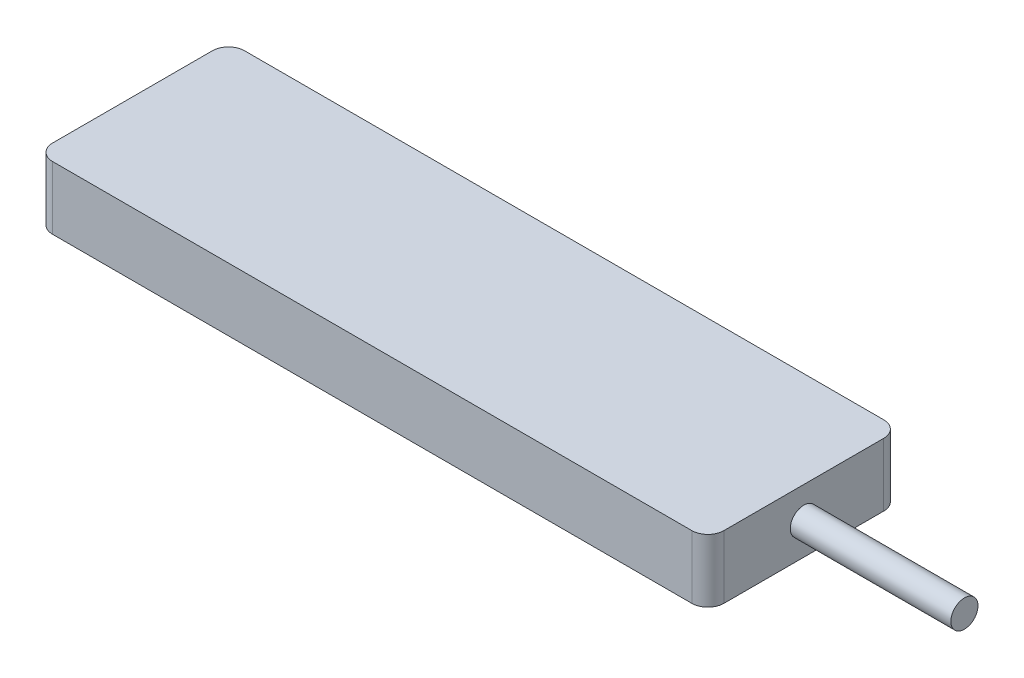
ISO-10303-21;
HEADER;
FILE_DESCRIPTION(('STEP AP214'),'2;1');
FILE_NAME('part.step','',(''),(''),'','','');
FILE_SCHEMA(('AUTOMOTIVE_DESIGN { 1 0 10303 214 1 1 1 1 }'));
ENDSEC;
DATA;
#1=APPLICATION_CONTEXT('core data for automotive mechanical design processes');
#2=APPLICATION_PROTOCOL_DEFINITION('international standard','automotive_design',2000,#1);
#3=PRODUCT_CONTEXT('',#1,'mechanical');
#4=PRODUCT('Part','Part','',(#3));
#5=PRODUCT_RELATED_PRODUCT_CATEGORY('part','',(#4));
#6=PRODUCT_DEFINITION_FORMATION('','',#4);
#7=PRODUCT_DEFINITION_CONTEXT('part definition',#1,'design');
#8=PRODUCT_DEFINITION('design','',#6,#7);
#9=PRODUCT_DEFINITION_SHAPE('','',#8);
#10=(LENGTH_UNIT() NAMED_UNIT(*) SI_UNIT(.MILLI.,.METRE.));
#11=(NAMED_UNIT(*) PLANE_ANGLE_UNIT() SI_UNIT($,.RADIAN.));
#12=(NAMED_UNIT(*) SI_UNIT($,.STERADIAN.) SOLID_ANGLE_UNIT());
#13=UNCERTAINTY_MEASURE_WITH_UNIT(LENGTH_MEASURE(1.E-05),#10,'distance_accuracy_value','');
#14=(GEOMETRIC_REPRESENTATION_CONTEXT(3) GLOBAL_UNCERTAINTY_ASSIGNED_CONTEXT((#13)) GLOBAL_UNIT_ASSIGNED_CONTEXT((#10,
#11,#12)) REPRESENTATION_CONTEXT('',''));
#15=CARTESIAN_POINT('',(0.,0.,0.));
#16=DIRECTION('',(0.,0.,1.));
#17=DIRECTION('',(1.,0.,0.));
#18=AXIS2_PLACEMENT_3D('',#15,#16,#17);
#19=CARTESIAN_POINT('',(0.,9.9695,0.));
#20=DIRECTION('',(1.,0.,0.));
#21=DIRECTION('',(0.,0.,-1.));
#22=AXIS2_PLACEMENT_3D('',#19,#20,#21);
#23=PLANE('',#22);
#24=DIRECTION('',(0.,0.,1.));
#25=VECTOR('',#24,1.);
#26=CARTESIAN_POINT('',(0.,0.,0.));
#27=LINE('',#26,#25);
#28=CARTESIAN_POINT('',(0.,0.,-27.813));
#29=VERTEX_POINT('',#28);
#30=CARTESIAN_POINT('',(0.,0.,-2.54));
#31=VERTEX_POINT('',#30);
#32=EDGE_CURVE('E322',#29,#31,#27,.T.);
#33=ORIENTED_EDGE('',*,*,#32,.T.);
#34=DIRECTION('',(0.,-1.,0.));
#35=VECTOR('',#34,1.);
#36=CARTESIAN_POINT('',(0.,9.9695,-2.54));
#37=LINE('',#36,#35);
#38=CARTESIAN_POINT('',(0.,9.9695,-2.54));
#39=VERTEX_POINT('',#38);
#40=EDGE_CURVE('E368',#31,#39,#37,.F.);
#41=ORIENTED_EDGE('',*,*,#40,.T.);
#42=DIRECTION('',(0.,0.,1.));
#43=VECTOR('',#42,1.);
#44=CARTESIAN_POINT('',(0.,9.9695,0.));
#45=LINE('',#44,#43);
#46=CARTESIAN_POINT('',(0.,9.9695,-27.813));
#47=VERTEX_POINT('',#46);
#48=EDGE_CURVE('E329',#47,#39,#45,.T.);
#49=ORIENTED_EDGE('',*,*,#48,.F.);
#50=DIRECTION('',(0.,-1.,0.));
#51=VECTOR('',#50,1.);
#52=CARTESIAN_POINT('',(0.,9.9695,-27.813));
#53=LINE('',#52,#51);
#54=EDGE_CURVE('E365',#47,#29,#53,.T.);
#55=ORIENTED_EDGE('',*,*,#54,.T.);
#56=EDGE_LOOP('',(#33,#41,#49,#55));
#57=FACE_BOUND('',#56,.T.);
#58=ADVANCED_FACE('F33',(#57),#23,.F.);
#59=CARTESIAN_POINT('',(0.,9.9695,0.));
#60=DIRECTION('',(0.,0.,-1.));
#61=DIRECTION('',(-1.,0.,0.));
#62=AXIS2_PLACEMENT_3D('',#59,#60,#61);
#63=PLANE('',#62);
#64=DIRECTION('',(1.,0.,0.));
#65=VECTOR('',#64,1.);
#66=CARTESIAN_POINT('',(0.,9.9695,0.));
#67=LINE('',#66,#65);
#68=CARTESIAN_POINT('',(2.54,9.9695,0.));
#69=VERTEX_POINT('',#68);
#70=CARTESIAN_POINT('',(103.632,9.9695,0.));
#71=VERTEX_POINT('',#70);
#72=EDGE_CURVE('E332',#69,#71,#67,.T.);
#73=ORIENTED_EDGE('',*,*,#72,.F.);
#74=DIRECTION('',(0.,-1.,0.));
#75=VECTOR('',#74,1.);
#76=CARTESIAN_POINT('',(2.54,9.9695,0.));
#77=LINE('',#76,#75);
#78=CARTESIAN_POINT('',(2.54,0.,0.));
#79=VERTEX_POINT('',#78);
#80=EDGE_CURVE('E354',#69,#79,#77,.T.);
#81=ORIENTED_EDGE('',*,*,#80,.T.);
#82=DIRECTION('',(1.,0.,0.));
#83=VECTOR('',#82,1.);
#84=CARTESIAN_POINT('',(0.,0.,0.));
#85=LINE('',#84,#83);
#86=CARTESIAN_POINT('',(103.632,0.,0.));
#87=VERTEX_POINT('',#86);
#88=EDGE_CURVE('E345',#79,#87,#85,.T.);
#89=ORIENTED_EDGE('',*,*,#88,.T.);
#90=DIRECTION('',(0.,-1.,0.));
#91=VECTOR('',#90,1.);
#92=CARTESIAN_POINT('',(103.632,9.9695,0.));
#93=LINE('',#92,#91);
#94=EDGE_CURVE('E342',#87,#71,#93,.F.);
#95=ORIENTED_EDGE('',*,*,#94,.T.);
#96=EDGE_LOOP('',(#73,#81,#89,#95));
#97=FACE_BOUND('',#96,.T.);
#98=ADVANCED_FACE('F420',(#97),#63,.F.);
#99=CARTESIAN_POINT('',(106.172,9.9695,0.));
#100=DIRECTION('',(-1.,0.,0.));
#101=DIRECTION('',(0.,0.,1.));
#102=AXIS2_PLACEMENT_3D('',#99,#100,#101);
#103=PLANE('',#102);
#104=CARTESIAN_POINT('',(106.172,4.98475,-15.1765));
#105=DIRECTION('',(-1.,0.,0.));
#106=DIRECTION('',(0.,0.,1.));
#107=AXIS2_PLACEMENT_3D('',#104,#105,#106);
#108=CIRCLE('',#107,2.1463);
#109=CARTESIAN_POINT('',(106.172,4.98475,-13.0302));
#110=VERTEX_POINT('',#109);
#111=EDGE_CURVE('E11',#110,#110,#108,.F.);
#112=ORIENTED_EDGE('',*,*,#111,.F.);
#113=EDGE_LOOP('',(#112));
#114=FACE_BOUND('',#113,.T.);
#115=DIRECTION('',(0.,0.,-1.));
#116=VECTOR('',#115,1.);
#117=CARTESIAN_POINT('',(106.172,0.,0.));
#118=LINE('',#117,#116);
#119=CARTESIAN_POINT('',(106.172,0.,-2.54));
#120=VERTEX_POINT('',#119);
#121=CARTESIAN_POINT('',(106.172,0.,-27.813));
#122=VERTEX_POINT('',#121);
#123=EDGE_CURVE('E348',#120,#122,#118,.T.);
#124=ORIENTED_EDGE('',*,*,#123,.T.);
#125=DIRECTION('',(0.,-1.,0.));
#126=VECTOR('',#125,1.);
#127=CARTESIAN_POINT('',(106.172,9.9695,-27.813));
#128=LINE('',#127,#126);
#129=CARTESIAN_POINT('',(106.172,9.9695,-27.813));
#130=VERTEX_POINT('',#129);
#131=EDGE_CURVE('E41',#122,#130,#128,.F.);
#132=ORIENTED_EDGE('',*,*,#131,.T.);
#133=DIRECTION('',(0.,0.,-1.));
#134=VECTOR('',#133,1.);
#135=CARTESIAN_POINT('',(106.172,9.9695,0.));
#136=LINE('',#135,#134);
#137=CARTESIAN_POINT('',(106.172,9.9695,-2.54));
#138=VERTEX_POINT('',#137);
#139=EDGE_CURVE('E336',#138,#130,#136,.T.);
#140=ORIENTED_EDGE('',*,*,#139,.F.);
#141=DIRECTION('',(0.,-1.,0.));
#142=VECTOR('',#141,1.);
#143=CARTESIAN_POINT('',(106.172,9.9695,-2.54));
#144=LINE('',#143,#142);
#145=EDGE_CURVE('E383',#138,#120,#144,.T.);
#146=ORIENTED_EDGE('',*,*,#145,.T.);
#147=EDGE_LOOP('',(#124,#132,#140,#146));
#148=FACE_BOUND('',#147,.T.);
#149=ADVANCED_FACE('F388',(#114,#148),#103,.F.);
#150=CARTESIAN_POINT('',(0.,9.9695,-30.353));
#151=DIRECTION('',(0.,0.,1.));
#152=DIRECTION('',(1.,0.,0.));
#153=AXIS2_PLACEMENT_3D('',#150,#151,#152);
#154=PLANE('',#153);
#155=DIRECTION('',(-1.,0.,0.));
#156=VECTOR('',#155,1.);
#157=CARTESIAN_POINT('',(56.4642,2.44475,-30.353));
#158=LINE('',#157,#156);
#159=CARTESIAN_POINT('',(56.4642,2.44475,-30.353));
#160=VERTEX_POINT('',#159);
#161=CARTESIAN_POINT('',(43.8912,2.44475,-30.353));
#162=VERTEX_POINT('',#161);
#163=EDGE_CURVE('E225',#160,#162,#158,.T.);
#164=ORIENTED_EDGE('',*,*,#163,.F.);
#165=DIRECTION('',(0.,-1.,0.));
#166=VECTOR('',#165,1.);
#167=CARTESIAN_POINT('',(56.4642,2.44475,-30.353));
#168=LINE('',#167,#166);
#169=CARTESIAN_POINT('',(56.4642,7.52475,-30.353));
#170=VERTEX_POINT('',#169);
#171=EDGE_CURVE('E48',#170,#160,#168,.T.);
#172=ORIENTED_EDGE('',*,*,#171,.F.);
#173=DIRECTION('',(1.,0.,0.));
#174=VECTOR('',#173,1.);
#175=CARTESIAN_POINT('',(56.4642,7.52475,-30.353));
#176=LINE('',#175,#174);
#177=CARTESIAN_POINT('',(43.8912,7.52475,-30.353));
#178=VERTEX_POINT('',#177);
#179=EDGE_CURVE('E214',#178,#170,#176,.T.);
#180=ORIENTED_EDGE('',*,*,#179,.F.);
#181=DIRECTION('',(0.,1.,0.));
#182=VECTOR('',#181,1.);
#183=CARTESIAN_POINT('',(43.8912,2.44475,-30.353));
#184=LINE('',#183,#182);
#185=EDGE_CURVE('E217',#162,#178,#184,.T.);
#186=ORIENTED_EDGE('',*,*,#185,.F.);
#187=EDGE_LOOP('',(#164,#172,#180,#186));
#188=FACE_BOUND('',#187,.T.);
#189=DIRECTION('',(-1.,0.,0.));
#190=VECTOR('',#189,1.);
#191=CARTESIAN_POINT('',(36.5887,2.44475,-30.353));
#192=LINE('',#191,#190);
#193=CARTESIAN_POINT('',(36.5887,2.44475,-30.353));
#194=VERTEX_POINT('',#193);
#195=CARTESIAN_POINT('',(24.0157,2.44475,-30.353));
#196=VERTEX_POINT('',#195);
#197=EDGE_CURVE('E251',#194,#196,#192,.T.);
#198=ORIENTED_EDGE('',*,*,#197,.F.);
#199=DIRECTION('',(0.,-1.,0.));
#200=VECTOR('',#199,1.);
#201=CARTESIAN_POINT('',(36.5887,2.44475,-30.353));
#202=LINE('',#201,#200);
#203=CARTESIAN_POINT('',(36.5887,7.52475,-30.353));
#204=VERTEX_POINT('',#203);
#205=EDGE_CURVE('E56',#204,#194,#202,.T.);
#206=ORIENTED_EDGE('',*,*,#205,.F.);
#207=DIRECTION('',(1.,0.,0.));
#208=VECTOR('',#207,1.);
#209=CARTESIAN_POINT('',(36.5887,7.52475,-30.353));
#210=LINE('',#209,#208);
#211=CARTESIAN_POINT('',(24.0157,7.52475,-30.353));
#212=VERTEX_POINT('',#211);
#213=EDGE_CURVE('E240',#212,#204,#210,.T.);
#214=ORIENTED_EDGE('',*,*,#213,.F.);
#215=DIRECTION('',(0.,1.,0.));
#216=VECTOR('',#215,1.);
#217=CARTESIAN_POINT('',(24.0157,2.44475,-30.353));
#218=LINE('',#217,#216);
#219=EDGE_CURVE('E255',#196,#212,#218,.T.);
#220=ORIENTED_EDGE('',*,*,#219,.F.);
#221=EDGE_LOOP('',(#198,#206,#214,#220));
#222=FACE_BOUND('',#221,.T.);
#223=DIRECTION('',(-1.,0.,0.));
#224=VECTOR('',#223,1.);
#225=CARTESIAN_POINT('',(16.7132,2.44475,-30.353));
#226=LINE('',#225,#224);
#227=CARTESIAN_POINT('',(16.7132,2.44475,-30.353));
#228=VERTEX_POINT('',#227);
#229=CARTESIAN_POINT('',(4.1402,2.44475,-30.353));
#230=VERTEX_POINT('',#229);
#231=EDGE_CURVE('E282',#228,#230,#226,.T.);
#232=ORIENTED_EDGE('',*,*,#231,.F.);
#233=DIRECTION('',(0.,-1.,0.));
#234=VECTOR('',#233,1.);
#235=CARTESIAN_POINT('',(16.7132,2.44475,-30.353));
#236=LINE('',#235,#234);
#237=CARTESIAN_POINT('',(16.7132,7.52475,-30.353));
#238=VERTEX_POINT('',#237);
#239=EDGE_CURVE('E280',#238,#228,#236,.T.);
#240=ORIENTED_EDGE('',*,*,#239,.F.);
#241=DIRECTION('',(1.,0.,0.));
#242=VECTOR('',#241,1.);
#243=CARTESIAN_POINT('',(16.7132,7.52475,-30.353));
#244=LINE('',#243,#242);
#245=CARTESIAN_POINT('',(4.1402,7.52475,-30.353));
#246=VERTEX_POINT('',#245);
#247=EDGE_CURVE('E270',#246,#238,#244,.T.);
#248=ORIENTED_EDGE('',*,*,#247,.F.);
#249=DIRECTION('',(0.,1.,0.));
#250=VECTOR('',#249,1.);
#251=CARTESIAN_POINT('',(4.1402,2.44475,-30.353));
#252=LINE('',#251,#250);
#253=EDGE_CURVE('E285',#230,#246,#252,.T.);
#254=ORIENTED_EDGE('',*,*,#253,.F.);
#255=EDGE_LOOP('',(#232,#240,#248,#254));
#256=FACE_BOUND('',#255,.T.);
#257=DIRECTION('',(-1.,0.,0.));
#258=VECTOR('',#257,1.);
#259=CARTESIAN_POINT('',(76.3397,2.44475,-30.353));
#260=LINE('',#259,#258);
#261=CARTESIAN_POINT('',(76.3397,2.44475,-30.353));
#262=VERTEX_POINT('',#261);
#263=CARTESIAN_POINT('',(63.7667,2.44475,-30.353));
#264=VERTEX_POINT('',#263);
#265=EDGE_CURVE('E312',#262,#264,#260,.T.);
#266=ORIENTED_EDGE('',*,*,#265,.F.);
#267=DIRECTION('',(0.,-1.,0.));
#268=VECTOR('',#267,1.);
#269=CARTESIAN_POINT('',(76.3397,2.44475,-30.353));
#270=LINE('',#269,#268);
#271=CARTESIAN_POINT('',(76.3397,7.52475,-30.353));
#272=VERTEX_POINT('',#271);
#273=EDGE_CURVE('E232',#272,#262,#270,.T.);
#274=ORIENTED_EDGE('',*,*,#273,.F.);
#275=DIRECTION('',(1.,0.,0.));
#276=VECTOR('',#275,1.);
#277=CARTESIAN_POINT('',(76.3397,7.52475,-30.353));
#278=LINE('',#277,#276);
#279=CARTESIAN_POINT('',(63.7667,7.52475,-30.353));
#280=VERTEX_POINT('',#279);
#281=EDGE_CURVE('E301',#280,#272,#278,.T.);
#282=ORIENTED_EDGE('',*,*,#281,.F.);
#283=DIRECTION('',(0.,1.,0.));
#284=VECTOR('',#283,1.);
#285=CARTESIAN_POINT('',(63.7667,2.44475,-30.353));
#286=LINE('',#285,#284);
#287=EDGE_CURVE('E315',#264,#280,#286,.T.);
#288=ORIENTED_EDGE('',*,*,#287,.F.);
#289=EDGE_LOOP('',(#266,#274,#282,#288));
#290=FACE_BOUND('',#289,.T.);
#291=DIRECTION('',(-1.,0.,0.));
#292=VECTOR('',#291,1.);
#293=CARTESIAN_POINT('',(0.,0.,-30.353));
#294=LINE('',#293,#292);
#295=CARTESIAN_POINT('',(103.632,0.,-30.353));
#296=VERTEX_POINT('',#295);
#297=CARTESIAN_POINT('',(2.54,0.,-30.353));
#298=VERTEX_POINT('',#297);
#299=EDGE_CURVE('E333',#296,#298,#294,.T.);
#300=ORIENTED_EDGE('',*,*,#299,.T.);
#301=DIRECTION('',(0.,-1.,0.));
#302=VECTOR('',#301,1.);
#303=CARTESIAN_POINT('',(2.54,9.9695,-30.353));
#304=LINE('',#303,#302);
#305=CARTESIAN_POINT('',(2.54,9.9695,-30.353));
#306=VERTEX_POINT('',#305);
#307=EDGE_CURVE('E381',#298,#306,#304,.F.);
#308=ORIENTED_EDGE('',*,*,#307,.T.);
#309=DIRECTION('',(-1.,0.,0.));
#310=VECTOR('',#309,1.);
#311=CARTESIAN_POINT('',(0.,9.9695,-30.353));
#312=LINE('',#311,#310);
#313=CARTESIAN_POINT('',(103.632,9.9695,-30.353));
#314=VERTEX_POINT('',#313);
#315=EDGE_CURVE('E339',#314,#306,#312,.T.);
#316=ORIENTED_EDGE('',*,*,#315,.F.);
#317=DIRECTION('',(0.,-1.,0.));
#318=VECTOR('',#317,1.);
#319=CARTESIAN_POINT('',(103.632,9.9695,-30.353));
#320=LINE('',#319,#318);
#321=EDGE_CURVE('E378',#314,#296,#320,.T.);
#322=ORIENTED_EDGE('',*,*,#321,.T.);
#323=EDGE_LOOP('',(#300,#308,#316,#322));
#324=FACE_BOUND('',#323,.T.);
#325=ADVANCED_FACE('F401',(#188,#222,#256,#290,#324),#154,.F.);
#326=CARTESIAN_POINT('',(0.,9.9695,0.));
#327=DIRECTION('',(0.,-1.,0.));
#328=DIRECTION('',(0.,0.,-1.));
#329=AXIS2_PLACEMENT_3D('',#326,#327,#328);
#330=PLANE('',#329);
#331=ORIENTED_EDGE('',*,*,#48,.T.);
#332=CARTESIAN_POINT('',(2.54,9.9695,-2.54));
#333=DIRECTION('',(0.,-1.,0.));
#334=DIRECTION('',(0.,0.,-1.));
#335=AXIS2_PLACEMENT_3D('',#332,#333,#334);
#336=CIRCLE('',#335,2.54);
#337=EDGE_CURVE('E376',#39,#69,#336,.F.);
#338=ORIENTED_EDGE('',*,*,#337,.T.);
#339=ORIENTED_EDGE('',*,*,#72,.T.);
#340=CARTESIAN_POINT('',(103.632,9.9695,-2.54));
#341=DIRECTION('',(0.,-1.,0.));
#342=DIRECTION('',(0.,0.,-1.));
#343=AXIS2_PLACEMENT_3D('',#340,#341,#342);
#344=CIRCLE('',#343,2.54);
#345=EDGE_CURVE('E370',#71,#138,#344,.F.);
#346=ORIENTED_EDGE('',*,*,#345,.T.);
#347=ORIENTED_EDGE('',*,*,#139,.T.);
#348=CARTESIAN_POINT('',(103.632,9.9695,-27.813));
#349=DIRECTION('',(0.,-1.,0.));
#350=DIRECTION('',(0.,0.,-1.));
#351=AXIS2_PLACEMENT_3D('',#348,#349,#350);
#352=CIRCLE('',#351,2.54);
#353=EDGE_CURVE('E372',#130,#314,#352,.F.);
#354=ORIENTED_EDGE('',*,*,#353,.T.);
#355=ORIENTED_EDGE('',*,*,#315,.T.);
#356=CARTESIAN_POINT('',(2.54,9.9695,-27.813));
#357=DIRECTION('',(0.,-1.,0.));
#358=DIRECTION('',(0.,0.,-1.));
#359=AXIS2_PLACEMENT_3D('',#356,#357,#358);
#360=CIRCLE('',#359,2.54);
#361=EDGE_CURVE('E374',#306,#47,#360,.F.);
#362=ORIENTED_EDGE('',*,*,#361,.T.);
#363=EDGE_LOOP('',(#331,#338,#339,#346,#347,#354,#355,#362));
#364=FACE_BOUND('',#363,.T.);
#365=ADVANCED_FACE('F394',(#364),#330,.F.);
#366=CARTESIAN_POINT('',(0.,0.,0.));
#367=DIRECTION('',(0.,-1.,0.));
#368=DIRECTION('',(0.,0.,-1.));
#369=AXIS2_PLACEMENT_3D('',#366,#367,#368);
#370=PLANE('',#369);
#371=ORIENTED_EDGE('',*,*,#88,.F.);
#372=CARTESIAN_POINT('',(2.54,0.,-2.54));
#373=DIRECTION('',(0.,-1.,0.));
#374=DIRECTION('',(0.,0.,-1.));
#375=AXIS2_PLACEMENT_3D('',#372,#373,#374);
#376=CIRCLE('',#375,2.54);
#377=EDGE_CURVE('E363',#79,#31,#376,.T.);
#378=ORIENTED_EDGE('',*,*,#377,.T.);
#379=ORIENTED_EDGE('',*,*,#32,.F.);
#380=CARTESIAN_POINT('',(2.54,0.,-27.813));
#381=DIRECTION('',(0.,-1.,0.));
#382=DIRECTION('',(0.,0.,-1.));
#383=AXIS2_PLACEMENT_3D('',#380,#381,#382);
#384=CIRCLE('',#383,2.54);
#385=EDGE_CURVE('E361',#29,#298,#384,.T.);
#386=ORIENTED_EDGE('',*,*,#385,.T.);
#387=ORIENTED_EDGE('',*,*,#299,.F.);
#388=CARTESIAN_POINT('',(103.632,0.,-27.813));
#389=DIRECTION('',(0.,-1.,0.));
#390=DIRECTION('',(0.,0.,-1.));
#391=AXIS2_PLACEMENT_3D('',#388,#389,#390);
#392=CIRCLE('',#391,2.54);
#393=EDGE_CURVE('E359',#296,#122,#392,.T.);
#394=ORIENTED_EDGE('',*,*,#393,.T.);
#395=ORIENTED_EDGE('',*,*,#123,.F.);
#396=CARTESIAN_POINT('',(103.632,0.,-2.54));
#397=DIRECTION('',(0.,-1.,0.));
#398=DIRECTION('',(0.,0.,-1.));
#399=AXIS2_PLACEMENT_3D('',#396,#397,#398);
#400=CIRCLE('',#399,2.54);
#401=EDGE_CURVE('E357',#120,#87,#400,.T.);
#402=ORIENTED_EDGE('',*,*,#401,.T.);
#403=EDGE_LOOP('',(#371,#378,#379,#386,#387,#394,#395,#402));
#404=FACE_BOUND('',#403,.T.);
#405=ADVANCED_FACE('F405',(#404),#370,.T.);
#406=CARTESIAN_POINT('',(2.54,9.9695,-2.54));
#407=DIRECTION('',(0.,-1.,0.));
#408=DIRECTION('',(0.,0.,-1.));
#409=AXIS2_PLACEMENT_3D('',#406,#407,#408);
#410=CYLINDRICAL_SURFACE('',#409,2.54);
#411=ORIENTED_EDGE('',*,*,#337,.F.);
#412=ORIENTED_EDGE('',*,*,#40,.F.);
#413=ORIENTED_EDGE('',*,*,#377,.F.);
#414=ORIENTED_EDGE('',*,*,#80,.F.);
#415=EDGE_LOOP('',(#411,#412,#413,#414));
#416=FACE_BOUND('',#415,.T.);
#417=ADVANCED_FACE('F418',(#416),#410,.T.);
#418=CARTESIAN_POINT('',(2.54,9.9695,-27.813));
#419=DIRECTION('',(0.,-1.,0.));
#420=DIRECTION('',(0.,0.,-1.));
#421=AXIS2_PLACEMENT_3D('',#418,#419,#420);
#422=CYLINDRICAL_SURFACE('',#421,2.54);
#423=ORIENTED_EDGE('',*,*,#361,.F.);
#424=ORIENTED_EDGE('',*,*,#307,.F.);
#425=ORIENTED_EDGE('',*,*,#385,.F.);
#426=ORIENTED_EDGE('',*,*,#54,.F.);
#427=EDGE_LOOP('',(#423,#424,#425,#426));
#428=FACE_BOUND('',#427,.T.);
#429=ADVANCED_FACE('F410',(#428),#422,.T.);
#430=CARTESIAN_POINT('',(103.632,9.9695,-27.813));
#431=DIRECTION('',(0.,-1.,0.));
#432=DIRECTION('',(0.,0.,-1.));
#433=AXIS2_PLACEMENT_3D('',#430,#431,#432);
#434=CYLINDRICAL_SURFACE('',#433,2.54);
#435=ORIENTED_EDGE('',*,*,#353,.F.);
#436=ORIENTED_EDGE('',*,*,#131,.F.);
#437=ORIENTED_EDGE('',*,*,#393,.F.);
#438=ORIENTED_EDGE('',*,*,#321,.F.);
#439=EDGE_LOOP('',(#435,#436,#437,#438));
#440=FACE_BOUND('',#439,.T.);
#441=ADVANCED_FACE('F398',(#440),#434,.T.);
#442=CARTESIAN_POINT('',(103.632,9.9695,-2.54));
#443=DIRECTION('',(0.,-1.,0.));
#444=DIRECTION('',(0.,0.,-1.));
#445=AXIS2_PLACEMENT_3D('',#442,#443,#444);
#446=CYLINDRICAL_SURFACE('',#445,2.54);
#447=ORIENTED_EDGE('',*,*,#345,.F.);
#448=ORIENTED_EDGE('',*,*,#94,.F.);
#449=ORIENTED_EDGE('',*,*,#401,.F.);
#450=ORIENTED_EDGE('',*,*,#145,.F.);
#451=EDGE_LOOP('',(#447,#448,#449,#450));
#452=FACE_BOUND('',#451,.T.);
#453=ADVANCED_FACE('F35',(#452),#446,.T.);
#454=CARTESIAN_POINT('',(76.3397,2.44475,-21.717));
#455=DIRECTION('',(1.,0.,0.));
#456=DIRECTION('',(0.,0.,-1.));
#457=AXIS2_PLACEMENT_3D('',#454,#455,#456);
#458=PLANE('',#457);
#459=ORIENTED_EDGE('',*,*,#273,.T.);
#460=DIRECTION('',(0.,0.,-1.));
#461=VECTOR('',#460,1.);
#462=CARTESIAN_POINT('',(76.3397,2.44475,-21.717));
#463=LINE('',#462,#461);
#464=CARTESIAN_POINT('',(76.3397,2.44475,-21.717));
#465=VERTEX_POINT('',#464);
#466=EDGE_CURVE('E310',#465,#262,#463,.T.);
#467=ORIENTED_EDGE('',*,*,#466,.F.);
#468=DIRECTION('',(0.,-1.,0.));
#469=VECTOR('',#468,1.);
#470=CARTESIAN_POINT('',(76.3397,2.44475,-21.717));
#471=LINE('',#470,#469);
#472=CARTESIAN_POINT('',(76.3397,7.52475,-21.717));
#473=VERTEX_POINT('',#472);
#474=EDGE_CURVE('E297',#473,#465,#471,.T.);
#475=ORIENTED_EDGE('',*,*,#474,.F.);
#476=DIRECTION('',(0.,0.,-1.));
#477=VECTOR('',#476,1.);
#478=CARTESIAN_POINT('',(76.3397,7.52475,-21.717));
#479=LINE('',#478,#477);
#480=EDGE_CURVE('E320',#473,#272,#479,.T.);
#481=ORIENTED_EDGE('',*,*,#480,.T.);
#482=EDGE_LOOP('',(#459,#467,#475,#481));
#483=FACE_BOUND('',#482,.T.);
#484=ADVANCED_FACE('F424',(#483),#458,.F.);
#485=CARTESIAN_POINT('',(76.3397,7.52475,-21.717));
#486=DIRECTION('',(0.,1.,0.));
#487=DIRECTION('',(0.,0.,1.));
#488=AXIS2_PLACEMENT_3D('',#485,#486,#487);
#489=PLANE('',#488);
#490=ORIENTED_EDGE('',*,*,#281,.T.);
#491=ORIENTED_EDGE('',*,*,#480,.F.);
#492=DIRECTION('',(1.,0.,0.));
#493=VECTOR('',#492,1.);
#494=CARTESIAN_POINT('',(76.3397,7.52475,-21.717));
#495=LINE('',#494,#493);
#496=CARTESIAN_POINT('',(63.7667,7.52475,-21.717));
#497=VERTEX_POINT('',#496);
#498=EDGE_CURVE('E307',#497,#473,#495,.T.);
#499=ORIENTED_EDGE('',*,*,#498,.F.);
#500=DIRECTION('',(0.,0.,-1.));
#501=VECTOR('',#500,1.);
#502=CARTESIAN_POINT('',(63.7667,7.52475,-21.717));
#503=LINE('',#502,#501);
#504=EDGE_CURVE('E323',#497,#280,#503,.T.);
#505=ORIENTED_EDGE('',*,*,#504,.T.);
#506=EDGE_LOOP('',(#490,#491,#499,#505));
#507=FACE_BOUND('',#506,.T.);
#508=ADVANCED_FACE('F429',(#507),#489,.F.);
#509=CARTESIAN_POINT('',(63.7667,2.44475,-21.717));
#510=DIRECTION('',(-1.,0.,0.));
#511=DIRECTION('',(0.,0.,1.));
#512=AXIS2_PLACEMENT_3D('',#509,#510,#511);
#513=PLANE('',#512);
#514=ORIENTED_EDGE('',*,*,#287,.T.);
#515=ORIENTED_EDGE('',*,*,#504,.F.);
#516=DIRECTION('',(0.,1.,0.));
#517=VECTOR('',#516,1.);
#518=CARTESIAN_POINT('',(63.7667,2.44475,-21.717));
#519=LINE('',#518,#517);
#520=CARTESIAN_POINT('',(63.7667,2.44475,-21.717));
#521=VERTEX_POINT('',#520);
#522=EDGE_CURVE('E304',#521,#497,#519,.T.);
#523=ORIENTED_EDGE('',*,*,#522,.F.);
#524=DIRECTION('',(0.,0.,-1.));
#525=VECTOR('',#524,1.);
#526=CARTESIAN_POINT('',(63.7667,2.44475,-21.717));
#527=LINE('',#526,#525);
#528=EDGE_CURVE('E325',#521,#264,#527,.T.);
#529=ORIENTED_EDGE('',*,*,#528,.T.);
#530=EDGE_LOOP('',(#514,#515,#523,#529));
#531=FACE_BOUND('',#530,.T.);
#532=ADVANCED_FACE('F484',(#531),#513,.F.);
#533=CARTESIAN_POINT('',(76.3397,2.44475,-21.717));
#534=DIRECTION('',(0.,-1.,0.));
#535=DIRECTION('',(1.,0.,0.));
#536=AXIS2_PLACEMENT_3D('',#533,#534,#535);
#537=PLANE('',#536);
#538=ORIENTED_EDGE('',*,*,#265,.T.);
#539=ORIENTED_EDGE('',*,*,#528,.F.);
#540=DIRECTION('',(-1.,0.,0.));
#541=VECTOR('',#540,1.);
#542=CARTESIAN_POINT('',(76.3397,2.44475,-21.717));
#543=LINE('',#542,#541);
#544=EDGE_CURVE('E300',#465,#521,#543,.T.);
#545=ORIENTED_EDGE('',*,*,#544,.F.);
#546=ORIENTED_EDGE('',*,*,#466,.T.);
#547=EDGE_LOOP('',(#538,#539,#545,#546));
#548=FACE_BOUND('',#547,.T.);
#549=ADVANCED_FACE('F494',(#548),#537,.F.);
#550=CARTESIAN_POINT('',(0.,0.,-21.717));
#551=DIRECTION('',(0.,0.,1.));
#552=DIRECTION('',(1.,0.,0.));
#553=AXIS2_PLACEMENT_3D('',#550,#551,#552);
#554=PLANE('',#553);
#555=ORIENTED_EDGE('',*,*,#474,.T.);
#556=ORIENTED_EDGE('',*,*,#544,.T.);
#557=ORIENTED_EDGE('',*,*,#522,.T.);
#558=ORIENTED_EDGE('',*,*,#498,.T.);
#559=EDGE_LOOP('',(#555,#556,#557,#558));
#560=FACE_BOUND('',#559,.T.);
#561=ADVANCED_FACE('F504',(#560),#554,.F.);
#562=CARTESIAN_POINT('',(16.7132,2.44475,-21.717));
#563=DIRECTION('',(1.,0.,0.));
#564=DIRECTION('',(0.,0.,-1.));
#565=AXIS2_PLACEMENT_3D('',#562,#563,#564);
#566=PLANE('',#565);
#567=ORIENTED_EDGE('',*,*,#239,.T.);
#568=DIRECTION('',(0.,0.,-1.));
#569=VECTOR('',#568,1.);
#570=CARTESIAN_POINT('',(16.7132,2.44475,-21.717));
#571=LINE('',#570,#569);
#572=CARTESIAN_POINT('',(16.7132,2.44475,-21.717));
#573=VERTEX_POINT('',#572);
#574=EDGE_CURVE('E279',#573,#228,#571,.T.);
#575=ORIENTED_EDGE('',*,*,#574,.F.);
#576=DIRECTION('',(0.,-1.,0.));
#577=VECTOR('',#576,1.);
#578=CARTESIAN_POINT('',(16.7132,2.44475,-21.717));
#579=LINE('',#578,#577);
#580=CARTESIAN_POINT('',(16.7132,7.52475,-21.717));
#581=VERTEX_POINT('',#580);
#582=EDGE_CURVE('E266',#581,#573,#579,.T.);
#583=ORIENTED_EDGE('',*,*,#582,.F.);
#584=DIRECTION('',(0.,0.,-1.));
#585=VECTOR('',#584,1.);
#586=CARTESIAN_POINT('',(16.7132,7.52475,-21.717));
#587=LINE('',#586,#585);
#588=EDGE_CURVE('E252',#581,#238,#587,.T.);
#589=ORIENTED_EDGE('',*,*,#588,.T.);
#590=EDGE_LOOP('',(#567,#575,#583,#589));
#591=FACE_BOUND('',#590,.T.);
#592=ADVANCED_FACE('F514',(#591),#566,.F.);
#593=CARTESIAN_POINT('',(16.7132,7.52475,-21.717));
#594=DIRECTION('',(0.,1.,0.));
#595=DIRECTION('',(0.,0.,1.));
#596=AXIS2_PLACEMENT_3D('',#593,#594,#595);
#597=PLANE('',#596);
#598=ORIENTED_EDGE('',*,*,#247,.T.);
#599=ORIENTED_EDGE('',*,*,#588,.F.);
#600=DIRECTION('',(1.,0.,0.));
#601=VECTOR('',#600,1.);
#602=CARTESIAN_POINT('',(16.7132,7.52475,-21.717));
#603=LINE('',#602,#601);
#604=CARTESIAN_POINT('',(4.1402,7.52475,-21.717));
#605=VERTEX_POINT('',#604);
#606=EDGE_CURVE('E276',#605,#581,#603,.T.);
#607=ORIENTED_EDGE('',*,*,#606,.F.);
#608=DIRECTION('',(0.,0.,-1.));
#609=VECTOR('',#608,1.);
#610=CARTESIAN_POINT('',(4.1402,7.52475,-21.717));
#611=LINE('',#610,#609);
#612=EDGE_CURVE('E291',#605,#246,#611,.T.);
#613=ORIENTED_EDGE('',*,*,#612,.T.);
#614=EDGE_LOOP('',(#598,#599,#607,#613));
#615=FACE_BOUND('',#614,.T.);
#616=ADVANCED_FACE('F524',(#615),#597,.F.);
#617=CARTESIAN_POINT('',(4.1402,2.44475,-21.717));
#618=DIRECTION('',(-1.,0.,0.));
#619=DIRECTION('',(0.,-1.,0.));
#620=AXIS2_PLACEMENT_3D('',#617,#618,#619);
#621=PLANE('',#620);
#622=ORIENTED_EDGE('',*,*,#253,.T.);
#623=ORIENTED_EDGE('',*,*,#612,.F.);
#624=DIRECTION('',(0.,1.,0.));
#625=VECTOR('',#624,1.);
#626=CARTESIAN_POINT('',(4.1402,2.44475,-21.717));
#627=LINE('',#626,#625);
#628=CARTESIAN_POINT('',(4.1402,2.44475,-21.717));
#629=VERTEX_POINT('',#628);
#630=EDGE_CURVE('E273',#629,#605,#627,.T.);
#631=ORIENTED_EDGE('',*,*,#630,.F.);
#632=DIRECTION('',(0.,0.,-1.));
#633=VECTOR('',#632,1.);
#634=CARTESIAN_POINT('',(4.1402,2.44475,-21.717));
#635=LINE('',#634,#633);
#636=EDGE_CURVE('E293',#629,#230,#635,.T.);
#637=ORIENTED_EDGE('',*,*,#636,.T.);
#638=EDGE_LOOP('',(#622,#623,#631,#637));
#639=FACE_BOUND('',#638,.T.);
#640=ADVANCED_FACE('F534',(#639),#621,.F.);
#641=CARTESIAN_POINT('',(16.7132,2.44475,-21.717));
#642=DIRECTION('',(0.,-1.,0.));
#643=DIRECTION('',(0.,0.,-1.));
#644=AXIS2_PLACEMENT_3D('',#641,#642,#643);
#645=PLANE('',#644);
#646=ORIENTED_EDGE('',*,*,#231,.T.);
#647=ORIENTED_EDGE('',*,*,#636,.F.);
#648=DIRECTION('',(-1.,0.,0.));
#649=VECTOR('',#648,1.);
#650=CARTESIAN_POINT('',(16.7132,2.44475,-21.717));
#651=LINE('',#650,#649);
#652=EDGE_CURVE('E269',#573,#629,#651,.T.);
#653=ORIENTED_EDGE('',*,*,#652,.F.);
#654=ORIENTED_EDGE('',*,*,#574,.T.);
#655=EDGE_LOOP('',(#646,#647,#653,#654));
#656=FACE_BOUND('',#655,.T.);
#657=ADVANCED_FACE('F544',(#656),#645,.F.);
#658=CARTESIAN_POINT('',(0.,0.,-21.717));
#659=DIRECTION('',(0.,0.,1.));
#660=DIRECTION('',(1.,0.,0.));
#661=AXIS2_PLACEMENT_3D('',#658,#659,#660);
#662=PLANE('',#661);
#663=ORIENTED_EDGE('',*,*,#582,.T.);
#664=ORIENTED_EDGE('',*,*,#652,.T.);
#665=ORIENTED_EDGE('',*,*,#630,.T.);
#666=ORIENTED_EDGE('',*,*,#606,.T.);
#667=EDGE_LOOP('',(#663,#664,#665,#666));
#668=FACE_BOUND('',#667,.T.);
#669=ADVANCED_FACE('F554',(#668),#662,.F.);
#670=CARTESIAN_POINT('',(36.5887,2.44475,-21.717));
#671=DIRECTION('',(1.,0.,0.));
#672=DIRECTION('',(0.,0.,-1.));
#673=AXIS2_PLACEMENT_3D('',#670,#671,#672);
#674=PLANE('',#673);
#675=ORIENTED_EDGE('',*,*,#205,.T.);
#676=DIRECTION('',(0.,0.,-1.));
#677=VECTOR('',#676,1.);
#678=CARTESIAN_POINT('',(36.5887,2.44475,-21.717));
#679=LINE('',#678,#677);
#680=CARTESIAN_POINT('',(36.5887,2.44475,-21.717));
#681=VERTEX_POINT('',#680);
#682=EDGE_CURVE('E249',#681,#194,#679,.T.);
#683=ORIENTED_EDGE('',*,*,#682,.F.);
#684=DIRECTION('',(0.,-1.,0.));
#685=VECTOR('',#684,1.);
#686=CARTESIAN_POINT('',(36.5887,2.44475,-21.717));
#687=LINE('',#686,#685);
#688=CARTESIAN_POINT('',(36.5887,7.52475,-21.717));
#689=VERTEX_POINT('',#688);
#690=EDGE_CURVE('E236',#689,#681,#687,.T.);
#691=ORIENTED_EDGE('',*,*,#690,.F.);
#692=DIRECTION('',(0.,0.,-1.));
#693=VECTOR('',#692,1.);
#694=CARTESIAN_POINT('',(36.5887,7.52475,-21.717));
#695=LINE('',#694,#693);
#696=EDGE_CURVE('E226',#689,#204,#695,.T.);
#697=ORIENTED_EDGE('',*,*,#696,.T.);
#698=EDGE_LOOP('',(#675,#683,#691,#697));
#699=FACE_BOUND('',#698,.T.);
#700=ADVANCED_FACE('F564',(#699),#674,.F.);
#701=CARTESIAN_POINT('',(36.5887,7.52475,-21.717));
#702=DIRECTION('',(0.,1.,0.));
#703=DIRECTION('',(0.,0.,1.));
#704=AXIS2_PLACEMENT_3D('',#701,#702,#703);
#705=PLANE('',#704);
#706=ORIENTED_EDGE('',*,*,#213,.T.);
#707=ORIENTED_EDGE('',*,*,#696,.F.);
#708=DIRECTION('',(1.,0.,0.));
#709=VECTOR('',#708,1.);
#710=CARTESIAN_POINT('',(36.5887,7.52475,-21.717));
#711=LINE('',#710,#709);
#712=CARTESIAN_POINT('',(24.0157,7.52475,-21.717));
#713=VERTEX_POINT('',#712);
#714=EDGE_CURVE('E246',#713,#689,#711,.T.);
#715=ORIENTED_EDGE('',*,*,#714,.F.);
#716=DIRECTION('',(0.,0.,-1.));
#717=VECTOR('',#716,1.);
#718=CARTESIAN_POINT('',(24.0157,7.52475,-21.717));
#719=LINE('',#718,#717);
#720=EDGE_CURVE('E261',#713,#212,#719,.T.);
#721=ORIENTED_EDGE('',*,*,#720,.T.);
#722=EDGE_LOOP('',(#706,#707,#715,#721));
#723=FACE_BOUND('',#722,.T.);
#724=ADVANCED_FACE('F574',(#723),#705,.F.);
#725=CARTESIAN_POINT('',(24.0157,2.44475,-21.717));
#726=DIRECTION('',(-1.,0.,0.));
#727=DIRECTION('',(0.,0.,1.));
#728=AXIS2_PLACEMENT_3D('',#725,#726,#727);
#729=PLANE('',#728);
#730=ORIENTED_EDGE('',*,*,#219,.T.);
#731=ORIENTED_EDGE('',*,*,#720,.F.);
#732=DIRECTION('',(0.,1.,0.));
#733=VECTOR('',#732,1.);
#734=CARTESIAN_POINT('',(24.0157,2.44475,-21.717));
#735=LINE('',#734,#733);
#736=CARTESIAN_POINT('',(24.0157,2.44475,-21.717));
#737=VERTEX_POINT('',#736);
#738=EDGE_CURVE('E243',#737,#713,#735,.T.);
#739=ORIENTED_EDGE('',*,*,#738,.F.);
#740=DIRECTION('',(0.,0.,-1.));
#741=VECTOR('',#740,1.);
#742=CARTESIAN_POINT('',(24.0157,2.44475,-21.717));
#743=LINE('',#742,#741);
#744=EDGE_CURVE('E263',#737,#196,#743,.T.);
#745=ORIENTED_EDGE('',*,*,#744,.T.);
#746=EDGE_LOOP('',(#730,#731,#739,#745));
#747=FACE_BOUND('',#746,.T.);
#748=ADVANCED_FACE('F583',(#747),#729,.F.);
#749=CARTESIAN_POINT('',(36.5887,2.44475,-21.717));
#750=DIRECTION('',(0.,-1.,0.));
#751=DIRECTION('',(0.,0.,-1.));
#752=AXIS2_PLACEMENT_3D('',#749,#750,#751);
#753=PLANE('',#752);
#754=ORIENTED_EDGE('',*,*,#197,.T.);
#755=ORIENTED_EDGE('',*,*,#744,.F.);
#756=DIRECTION('',(-1.,0.,0.));
#757=VECTOR('',#756,1.);
#758=CARTESIAN_POINT('',(36.5887,2.44475,-21.717));
#759=LINE('',#758,#757);
#760=EDGE_CURVE('E239',#681,#737,#759,.T.);
#761=ORIENTED_EDGE('',*,*,#760,.F.);
#762=ORIENTED_EDGE('',*,*,#682,.T.);
#763=EDGE_LOOP('',(#754,#755,#761,#762));
#764=FACE_BOUND('',#763,.T.);
#765=ADVANCED_FACE('F593',(#764),#753,.F.);
#766=CARTESIAN_POINT('',(0.,0.,-21.717));
#767=DIRECTION('',(0.,0.,1.));
#768=DIRECTION('',(1.,0.,0.));
#769=AXIS2_PLACEMENT_3D('',#766,#767,#768);
#770=PLANE('',#769);
#771=ORIENTED_EDGE('',*,*,#690,.T.);
#772=ORIENTED_EDGE('',*,*,#760,.T.);
#773=ORIENTED_EDGE('',*,*,#738,.T.);
#774=ORIENTED_EDGE('',*,*,#714,.T.);
#775=EDGE_LOOP('',(#771,#772,#773,#774));
#776=FACE_BOUND('',#775,.T.);
#777=ADVANCED_FACE('F603',(#776),#770,.F.);
#778=CARTESIAN_POINT('',(56.4642,2.44475,-21.717));
#779=DIRECTION('',(1.,0.,0.));
#780=DIRECTION('',(0.,0.,-1.));
#781=AXIS2_PLACEMENT_3D('',#778,#779,#780);
#782=PLANE('',#781);
#783=ORIENTED_EDGE('',*,*,#171,.T.);
#784=DIRECTION('',(0.,0.,-1.));
#785=VECTOR('',#784,1.);
#786=CARTESIAN_POINT('',(56.4642,2.44475,-21.717));
#787=LINE('',#786,#785);
#788=CARTESIAN_POINT('',(56.4642,2.44475,-21.717));
#789=VERTEX_POINT('',#788);
#790=EDGE_CURVE('E192',#789,#160,#787,.T.);
#791=ORIENTED_EDGE('',*,*,#790,.F.);
#792=DIRECTION('',(0.,-1.,0.));
#793=VECTOR('',#792,1.);
#794=CARTESIAN_POINT('',(56.4642,2.44475,-21.717));
#795=LINE('',#794,#793);
#796=CARTESIAN_POINT('',(56.4642,7.52475,-21.717));
#797=VERTEX_POINT('',#796);
#798=EDGE_CURVE('E196',#797,#789,#795,.T.);
#799=ORIENTED_EDGE('',*,*,#798,.F.);
#800=DIRECTION('',(0.,0.,-1.));
#801=VECTOR('',#800,1.);
#802=CARTESIAN_POINT('',(56.4642,7.52475,-21.717));
#803=LINE('',#802,#801);
#804=EDGE_CURVE('E230',#797,#170,#803,.T.);
#805=ORIENTED_EDGE('',*,*,#804,.T.);
#806=EDGE_LOOP('',(#783,#791,#799,#805));
#807=FACE_BOUND('',#806,.T.);
#808=ADVANCED_FACE('F194',(#807),#782,.F.);
#809=CARTESIAN_POINT('',(56.4642,7.52475,-21.717));
#810=DIRECTION('',(0.,1.,0.));
#811=DIRECTION('',(0.,0.,1.));
#812=AXIS2_PLACEMENT_3D('',#809,#810,#811);
#813=PLANE('',#812);
#814=ORIENTED_EDGE('',*,*,#179,.T.);
#815=ORIENTED_EDGE('',*,*,#804,.F.);
#816=DIRECTION('',(1.,0.,0.));
#817=VECTOR('',#816,1.);
#818=CARTESIAN_POINT('',(56.4642,7.52475,-21.717));
#819=LINE('',#818,#817);
#820=CARTESIAN_POINT('',(43.8912,7.52475,-21.717));
#821=VERTEX_POINT('',#820);
#822=EDGE_CURVE('E202',#821,#797,#819,.T.);
#823=ORIENTED_EDGE('',*,*,#822,.F.);
#824=DIRECTION('',(0.,0.,-1.));
#825=VECTOR('',#824,1.);
#826=CARTESIAN_POINT('',(43.8912,7.52475,-21.717));
#827=LINE('',#826,#825);
#828=EDGE_CURVE('E233',#821,#178,#827,.T.);
#829=ORIENTED_EDGE('',*,*,#828,.T.);
#830=EDGE_LOOP('',(#814,#815,#823,#829));
#831=FACE_BOUND('',#830,.T.);
#832=ADVANCED_FACE('F622',(#831),#813,.F.);
#833=CARTESIAN_POINT('',(43.8912,2.44475,-21.717));
#834=DIRECTION('',(-1.,0.,0.));
#835=DIRECTION('',(0.,0.,1.));
#836=AXIS2_PLACEMENT_3D('',#833,#834,#835);
#837=PLANE('',#836);
#838=ORIENTED_EDGE('',*,*,#185,.T.);
#839=ORIENTED_EDGE('',*,*,#828,.F.);
#840=DIRECTION('',(0.,1.,0.));
#841=VECTOR('',#840,1.);
#842=CARTESIAN_POINT('',(43.8912,2.44475,-21.717));
#843=LINE('',#842,#841);
#844=CARTESIAN_POINT('',(43.8912,2.44475,-21.717));
#845=VERTEX_POINT('',#844);
#846=EDGE_CURVE('E210',#845,#821,#843,.T.);
#847=ORIENTED_EDGE('',*,*,#846,.F.);
#848=DIRECTION('',(0.,0.,-1.));
#849=VECTOR('',#848,1.);
#850=CARTESIAN_POINT('',(43.8912,2.44475,-21.717));
#851=LINE('',#850,#849);
#852=EDGE_CURVE('E201',#845,#162,#851,.T.);
#853=ORIENTED_EDGE('',*,*,#852,.T.);
#854=EDGE_LOOP('',(#838,#839,#847,#853));
#855=FACE_BOUND('',#854,.T.);
#856=ADVANCED_FACE('F631',(#855),#837,.F.);
#857=CARTESIAN_POINT('',(56.4642,2.44475,-21.717));
#858=DIRECTION('',(0.,-1.,0.));
#859=DIRECTION('',(0.,0.,-1.));
#860=AXIS2_PLACEMENT_3D('',#857,#858,#859);
#861=PLANE('',#860);
#862=ORIENTED_EDGE('',*,*,#163,.T.);
#863=ORIENTED_EDGE('',*,*,#852,.F.);
#864=DIRECTION('',(-1.,0.,0.));
#865=VECTOR('',#864,1.);
#866=CARTESIAN_POINT('',(56.4642,2.44475,-21.717));
#867=LINE('',#866,#865);
#868=EDGE_CURVE('E205',#789,#845,#867,.T.);
#869=ORIENTED_EDGE('',*,*,#868,.F.);
#870=ORIENTED_EDGE('',*,*,#790,.T.);
#871=EDGE_LOOP('',(#862,#863,#869,#870));
#872=FACE_BOUND('',#871,.T.);
#873=ADVANCED_FACE('F206',(#872),#861,.F.);
#874=CARTESIAN_POINT('',(0.,0.,-21.717));
#875=DIRECTION('',(0.,0.,1.));
#876=DIRECTION('',(1.,0.,0.));
#877=AXIS2_PLACEMENT_3D('',#874,#875,#876);
#878=PLANE('',#877);
#879=ORIENTED_EDGE('',*,*,#798,.T.);
#880=ORIENTED_EDGE('',*,*,#868,.T.);
#881=ORIENTED_EDGE('',*,*,#846,.T.);
#882=ORIENTED_EDGE('',*,*,#822,.T.);
#883=EDGE_LOOP('',(#879,#880,#881,#882));
#884=FACE_BOUND('',#883,.T.);
#885=ADVANCED_FACE('F212',(#884),#878,.F.);
#886=CARTESIAN_POINT('',(131.572,4.98475,-15.1765));
#887=DIRECTION('',(-1.,0.,0.));
#888=DIRECTION('',(0.,0.,1.));
#889=AXIS2_PLACEMENT_3D('',#886,#887,#888);
#890=CYLINDRICAL_SURFACE('',#889,2.1463);
#891=CARTESIAN_POINT('',(131.572,4.98475,-15.1765));
#892=DIRECTION('',(1.,0.,0.));
#893=DIRECTION('',(0.,0.,-1.));
#894=AXIS2_PLACEMENT_3D('',#891,#892,#893);
#895=CIRCLE('',#894,2.1463);
#896=CARTESIAN_POINT('',(131.572,4.98475,-17.3228));
#897=VERTEX_POINT('',#896);
#898=EDGE_CURVE('E220',#897,#897,#895,.T.);
#899=ORIENTED_EDGE('',*,*,#898,.F.);
#900=EDGE_LOOP('',(#899));
#901=FACE_BOUND('',#900,.T.);
#902=ORIENTED_EDGE('',*,*,#111,.T.);
#903=EDGE_LOOP('',(#902));
#904=FACE_BOUND('',#903,.T.);
#905=ADVANCED_FACE('F658',(#901,#904),#890,.T.);
#906=CARTESIAN_POINT('',(131.572,4.98475,-15.1765));
#907=DIRECTION('',(1.,0.,0.));
#908=DIRECTION('',(0.,0.,-1.));
#909=AXIS2_PLACEMENT_3D('',#906,#907,#908);
#910=PLANE('',#909);
#911=ORIENTED_EDGE('',*,*,#898,.T.);
#912=EDGE_LOOP('',(#911));
#913=FACE_BOUND('',#912,.T.);
#914=ADVANCED_FACE('F674',(#913),#910,.T.);
#915=CLOSED_SHELL('',(#58,#98,#149,#325,#365,#405,#417,#429,#441,#453,#484,#508,#532,#549,#561,
#592,#616,#640,#657,#669,#700,#724,#748,#765,#777,#808,#832,#856,#873,#885,#905,#914));
#916=MANIFOLD_SOLID_BREP('B2',#915);
#917=ADVANCED_BREP_SHAPE_REPRESENTATION('',(#18,#916),#14);
#918=SHAPE_DEFINITION_REPRESENTATION(#9,#917);
ENDSEC;
END-ISO-10303-21;
